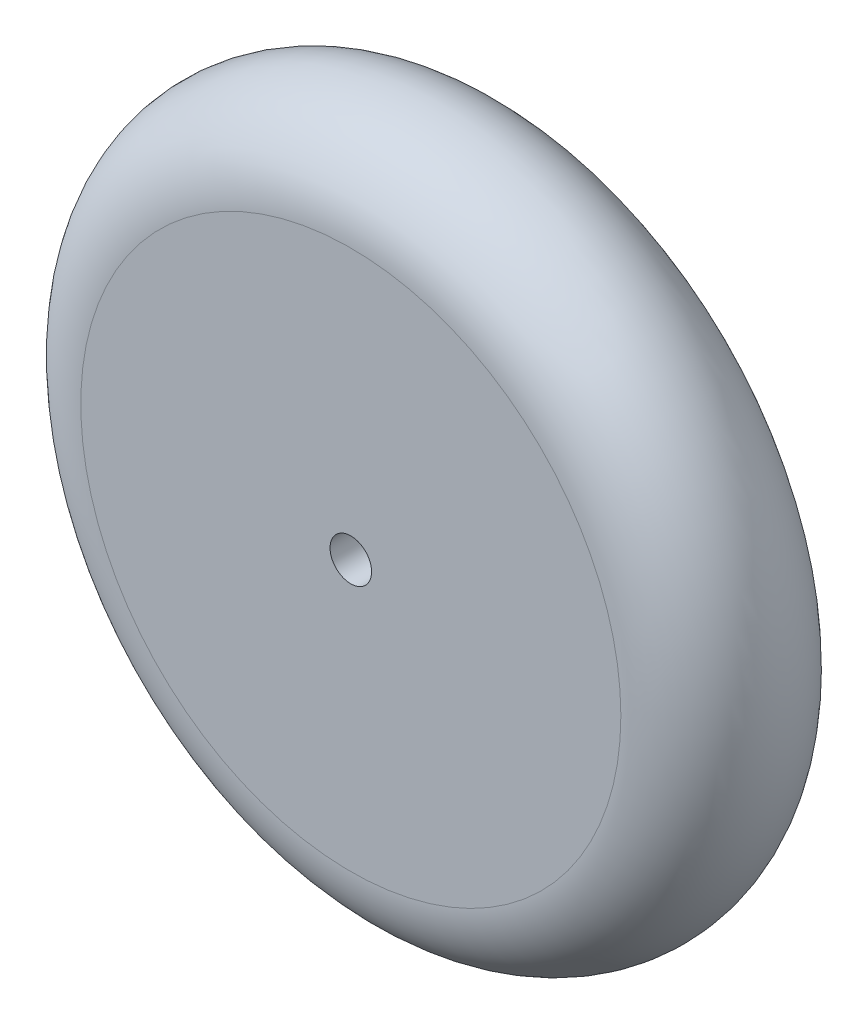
ISO-10303-21;
HEADER;
FILE_DESCRIPTION(('STEP AP214'),'2;1');
FILE_NAME('part.step','',(''),(''),'','','');
FILE_SCHEMA(('AUTOMOTIVE_DESIGN { 1 0 10303 214 1 1 1 1 }'));
ENDSEC;
DATA;
#1=APPLICATION_CONTEXT('core data for automotive mechanical design processes');
#2=APPLICATION_PROTOCOL_DEFINITION('international standard','automotive_design',2000,#1);
#3=PRODUCT_CONTEXT('',#1,'mechanical');
#4=PRODUCT('Part','Part','',(#3));
#5=PRODUCT_RELATED_PRODUCT_CATEGORY('part','',(#4));
#6=PRODUCT_DEFINITION_FORMATION('','',#4);
#7=PRODUCT_DEFINITION_CONTEXT('part definition',#1,'design');
#8=PRODUCT_DEFINITION('design','',#6,#7);
#9=PRODUCT_DEFINITION_SHAPE('','',#8);
#10=(LENGTH_UNIT() NAMED_UNIT(*) SI_UNIT(.MILLI.,.METRE.));
#11=(NAMED_UNIT(*) PLANE_ANGLE_UNIT() SI_UNIT($,.RADIAN.));
#12=(NAMED_UNIT(*) SI_UNIT($,.STERADIAN.) SOLID_ANGLE_UNIT());
#13=UNCERTAINTY_MEASURE_WITH_UNIT(LENGTH_MEASURE(1.E-05),#10,'distance_accuracy_value','');
#14=(GEOMETRIC_REPRESENTATION_CONTEXT(3) GLOBAL_UNCERTAINTY_ASSIGNED_CONTEXT((#13)) GLOBAL_UNIT_ASSIGNED_CONTEXT((#10,
#11,#12)) REPRESENTATION_CONTEXT('',''));
#15=CARTESIAN_POINT('',(0.,0.,0.));
#16=DIRECTION('',(0.,0.,1.));
#17=DIRECTION('',(1.,0.,0.));
#18=AXIS2_PLACEMENT_3D('',#15,#16,#17);
#19=CARTESIAN_POINT('',(5.,0.,-20.));
#20=DIRECTION('',(0.,0.,-1.));
#21=DIRECTION('',(-1.,0.,0.));
#22=AXIS2_PLACEMENT_3D('',#19,#20,#21);
#23=PLANE('',#22);
#24=CARTESIAN_POINT('',(0.,0.,-20.));
#25=DIRECTION('',(0.,0.,1.));
#26=DIRECTION('',(1.,0.,0.));
#27=AXIS2_PLACEMENT_3D('',#24,#25,#26);
#28=CIRCLE('',#27,5.);
#29=CARTESIAN_POINT('',(5.,0.,-20.));
#30=VERTEX_POINT('',#29);
#31=EDGE_CURVE('E44',#30,#30,#28,.T.);
#32=ORIENTED_EDGE('',*,*,#31,.T.);
#33=EDGE_LOOP('',(#32));
#34=FACE_BOUND('',#33,.T.);
#35=CARTESIAN_POINT('',(0.,0.,-20.));
#36=DIRECTION('',(0.,0.,1.));
#37=DIRECTION('',(1.,0.,0.));
#38=AXIS2_PLACEMENT_3D('',#35,#36,#37);
#39=CIRCLE('',#38,65.);
#40=CARTESIAN_POINT('',(65.,0.,-20.));
#41=VERTEX_POINT('',#40);
#42=EDGE_CURVE('E10',#41,#41,#39,.T.);
#43=ORIENTED_EDGE('',*,*,#42,.F.);
#44=EDGE_LOOP('',(#43));
#45=FACE_BOUND('',#44,.T.);
#46=ADVANCED_FACE('F30',(#34,#45),#23,.T.);
#47=CARTESIAN_POINT('',(0.,0.,0.));
#48=DIRECTION('',(0.,0.,1.));
#49=DIRECTION('',(1.,0.,0.));
#50=AXIS2_PLACEMENT_3D('',#47,#48,#49);
#51=TOROIDAL_SURFACE('',#50,65.,20.);
#52=ORIENTED_EDGE('',*,*,#42,.T.);
#53=EDGE_LOOP('',(#52));
#54=FACE_BOUND('',#53,.T.);
#55=CARTESIAN_POINT('',(0.,0.,20.));
#56=DIRECTION('',(0.,0.,1.));
#57=DIRECTION('',(1.,0.,0.));
#58=AXIS2_PLACEMENT_3D('',#55,#56,#57);
#59=CIRCLE('',#58,65.);
#60=CARTESIAN_POINT('',(65.,0.,20.));
#61=VERTEX_POINT('',#60);
#62=EDGE_CURVE('E36',#61,#61,#59,.T.);
#63=ORIENTED_EDGE('',*,*,#62,.F.);
#64=EDGE_LOOP('',(#63));
#65=FACE_BOUND('',#64,.T.);
#66=ADVANCED_FACE('F60',(#54,#65),#51,.T.);
#67=CARTESIAN_POINT('',(5.,0.,20.));
#68=DIRECTION('',(0.,0.,1.));
#69=DIRECTION('',(1.,0.,0.));
#70=AXIS2_PLACEMENT_3D('',#67,#68,#69);
#71=PLANE('',#70);
#72=ORIENTED_EDGE('',*,*,#62,.T.);
#73=EDGE_LOOP('',(#72));
#74=FACE_BOUND('',#73,.T.);
#75=CARTESIAN_POINT('',(0.,0.,20.));
#76=DIRECTION('',(0.,0.,1.));
#77=DIRECTION('',(1.,0.,0.));
#78=AXIS2_PLACEMENT_3D('',#75,#76,#77);
#79=CIRCLE('',#78,5.);
#80=CARTESIAN_POINT('',(5.,0.,20.));
#81=VERTEX_POINT('',#80);
#82=EDGE_CURVE('E40',#81,#81,#79,.T.);
#83=ORIENTED_EDGE('',*,*,#82,.F.);
#84=EDGE_LOOP('',(#83));
#85=FACE_BOUND('',#84,.T.);
#86=ADVANCED_FACE('F54',(#74,#85),#71,.T.);
#87=CARTESIAN_POINT('',(0.,0.,19.9095600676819));
#88=DIRECTION('',(0.,0.,1.));
#89=DIRECTION('',(1.,0.,0.));
#90=AXIS2_PLACEMENT_3D('',#87,#88,#89);
#91=CYLINDRICAL_SURFACE('',#90,5.);
#92=ORIENTED_EDGE('',*,*,#82,.T.);
#93=EDGE_LOOP('',(#92));
#94=FACE_BOUND('',#93,.T.);
#95=ORIENTED_EDGE('',*,*,#31,.F.);
#96=EDGE_LOOP('',(#95));
#97=FACE_BOUND('',#96,.T.);
#98=ADVANCED_FACE('F52',(#94,#97),#91,.F.);
#99=CLOSED_SHELL('',(#46,#66,#86,#98));
#100=MANIFOLD_SOLID_BREP('B2',#99);
#101=ADVANCED_BREP_SHAPE_REPRESENTATION('',(#18,#100),#14);
#102=SHAPE_DEFINITION_REPRESENTATION(#9,#101);
ENDSEC;
END-ISO-10303-21;
